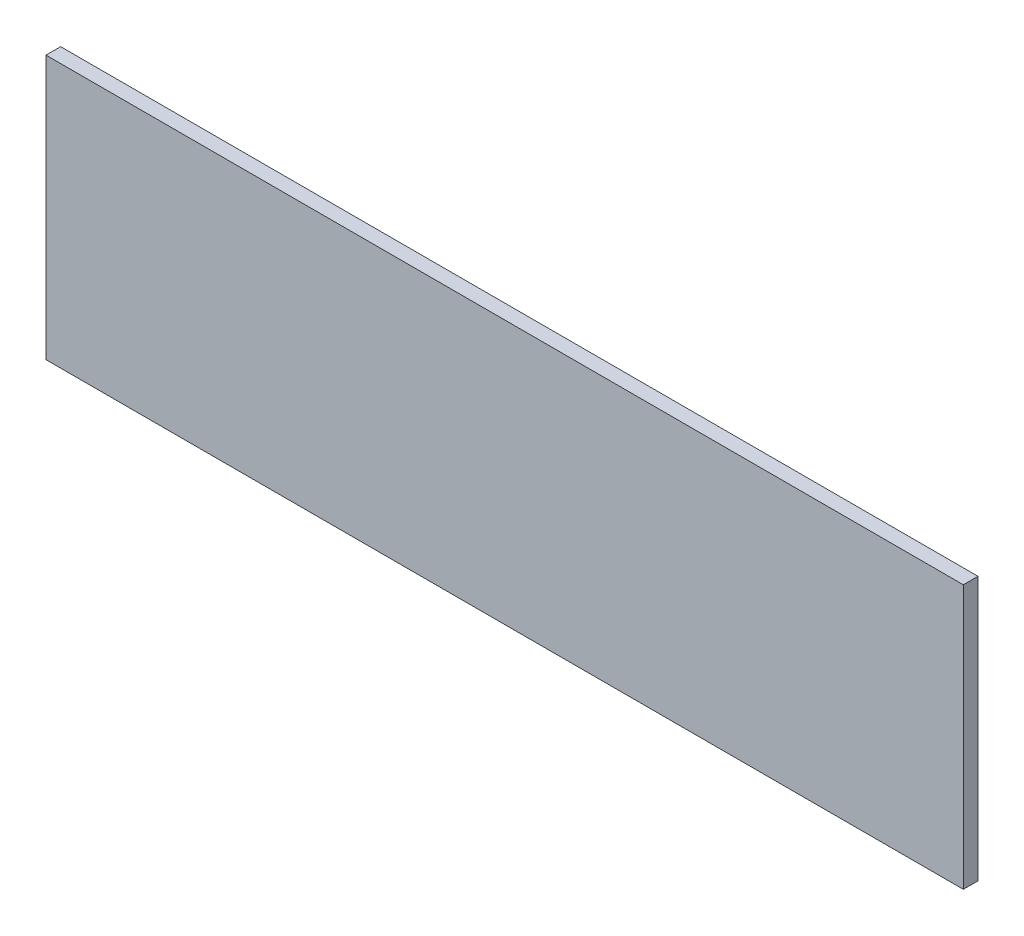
from build123d import *

# Parameters (mm, degrees)
ESQUISSE1_W        = 6260
ESQUISSE1_H        = 1800
BOSS_EXTRU_1_DEPTH = 100


with BuildPart() as part:
    # Esquisse1 → Boss.-Extru.1 (new body)
    with BuildSketch(Plane.XY):
        with Locations((-3130, 900)):
            Rectangle(ESQUISSE1_W, ESQUISSE1_H)
    extrude(amount=-BOSS_EXTRU_1_DEPTH)


solid = part.part
